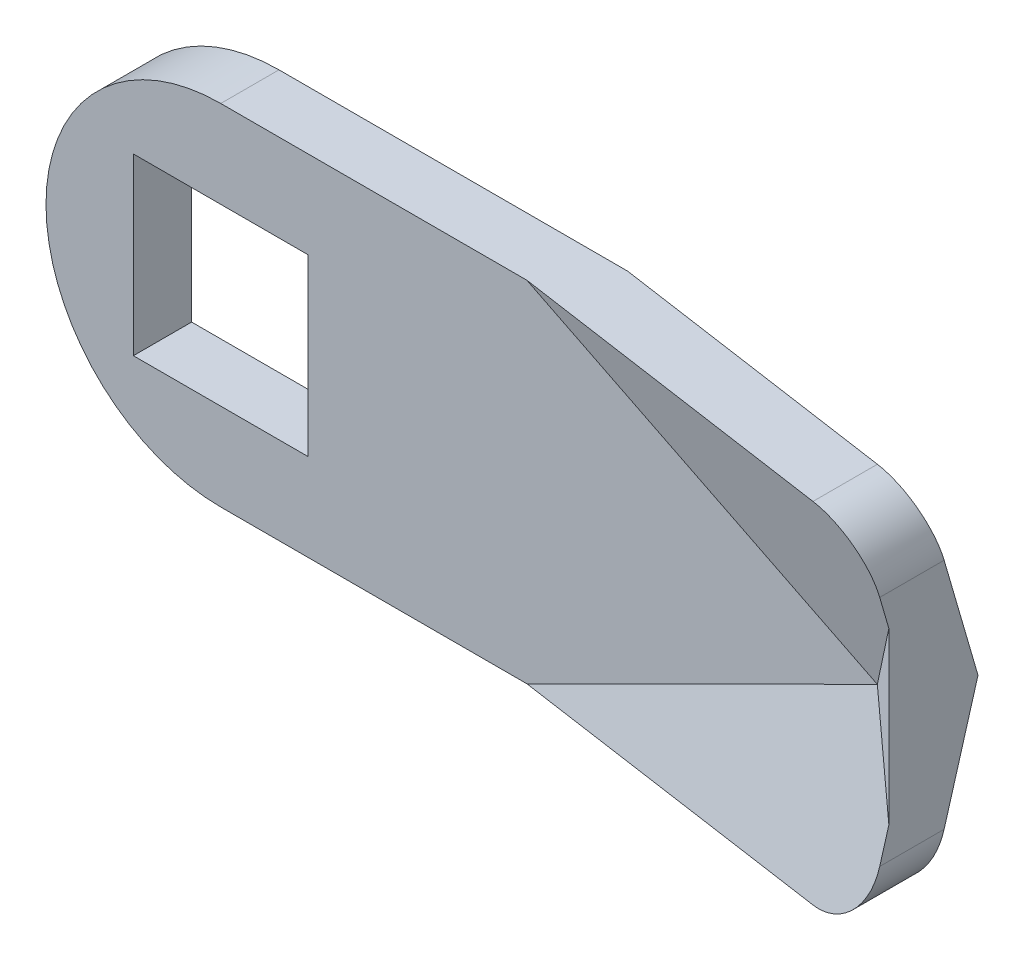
ISO-10303-21;
HEADER;
FILE_DESCRIPTION(('STEP AP214'),'2;1');
FILE_NAME('part.step','',(''),(''),'','','');
FILE_SCHEMA(('AUTOMOTIVE_DESIGN { 1 0 10303 214 1 1 1 1 }'));
ENDSEC;
DATA;
#1=APPLICATION_CONTEXT('core data for automotive mechanical design processes');
#2=APPLICATION_PROTOCOL_DEFINITION('international standard','automotive_design',2000,#1);
#3=PRODUCT_CONTEXT('',#1,'mechanical');
#4=PRODUCT('Part','Part','',(#3));
#5=PRODUCT_RELATED_PRODUCT_CATEGORY('part','',(#4));
#6=PRODUCT_DEFINITION_FORMATION('','',#4);
#7=PRODUCT_DEFINITION_CONTEXT('part definition',#1,'design');
#8=PRODUCT_DEFINITION('design','',#6,#7);
#9=PRODUCT_DEFINITION_SHAPE('','',#8);
#10=(LENGTH_UNIT() NAMED_UNIT(*) SI_UNIT(.MILLI.,.METRE.));
#11=(NAMED_UNIT(*) PLANE_ANGLE_UNIT() SI_UNIT($,.RADIAN.));
#12=(NAMED_UNIT(*) SI_UNIT($,.STERADIAN.) SOLID_ANGLE_UNIT());
#13=UNCERTAINTY_MEASURE_WITH_UNIT(LENGTH_MEASURE(1.E-05),#10,'distance_accuracy_value','');
#14=(GEOMETRIC_REPRESENTATION_CONTEXT(3) GLOBAL_UNCERTAINTY_ASSIGNED_CONTEXT((#13)) GLOBAL_UNIT_ASSIGNED_CONTEXT((#10,
#11,#12)) REPRESENTATION_CONTEXT('',''));
#15=CARTESIAN_POINT('',(0.,0.,0.));
#16=DIRECTION('',(0.,0.,1.));
#17=DIRECTION('',(1.,0.,0.));
#18=AXIS2_PLACEMENT_3D('',#15,#16,#17);
#19=CARTESIAN_POINT('',(-6.,-6.,0.));
#20=DIRECTION('',(0.,0.,1.));
#21=DIRECTION('',(-1.,0.,0.));
#22=AXIS2_PLACEMENT_3D('',#19,#20,#21);
#23=PLANE('',#22);
#24=DIRECTION('',(-1.,0.,0.));
#25=VECTOR('',#24,1.);
#26=CARTESIAN_POINT('',(3.,3.,0.));
#27=LINE('',#26,#25);
#28=CARTESIAN_POINT('',(3.,3.,0.));
#29=VERTEX_POINT('',#28);
#30=CARTESIAN_POINT('',(-3.,3.,0.));
#31=VERTEX_POINT('',#30);
#32=EDGE_CURVE('E248',#29,#31,#27,.T.);
#33=ORIENTED_EDGE('',*,*,#32,.T.);
#34=DIRECTION('',(0.,1.,0.));
#35=VECTOR('',#34,1.);
#36=CARTESIAN_POINT('',(-3.,-3.,0.));
#37=LINE('',#36,#35);
#38=CARTESIAN_POINT('',(-3.,-3.,0.));
#39=VERTEX_POINT('',#38);
#40=EDGE_CURVE('E288',#39,#31,#37,.T.);
#41=ORIENTED_EDGE('',*,*,#40,.F.);
#42=DIRECTION('',(1.,0.,0.));
#43=VECTOR('',#42,1.);
#44=CARTESIAN_POINT('',(-3.,-3.,0.));
#45=LINE('',#44,#43);
#46=CARTESIAN_POINT('',(3.,-3.,0.));
#47=VERTEX_POINT('',#46);
#48=EDGE_CURVE('E294',#39,#47,#45,.T.);
#49=ORIENTED_EDGE('',*,*,#48,.T.);
#50=DIRECTION('',(0.,-1.,0.));
#51=VECTOR('',#50,1.);
#52=CARTESIAN_POINT('',(3.,3.,0.));
#53=LINE('',#52,#51);
#54=EDGE_CURVE('E291',#29,#47,#53,.T.);
#55=ORIENTED_EDGE('',*,*,#54,.F.);
#56=EDGE_LOOP('',(#33,#41,#49,#55));
#57=FACE_BOUND('',#56,.T.);
#58=DIRECTION('',(0.,1.,0.));
#59=VECTOR('',#58,1.);
#60=CARTESIAN_POINT('',(5.,-2.85,0.));
#61=LINE('',#60,#59);
#62=CARTESIAN_POINT('',(5.,-2.85,0.));
#63=VERTEX_POINT('',#62);
#64=CARTESIAN_POINT('',(5.,2.85,0.));
#65=VERTEX_POINT('',#64);
#66=EDGE_CURVE('E250',#63,#65,#61,.T.);
#67=ORIENTED_EDGE('',*,*,#66,.F.);
#68=DIRECTION('',(1.,0.,0.));
#69=VECTOR('',#68,1.);
#70=CARTESIAN_POINT('',(5.,-2.85,0.));
#71=LINE('',#70,#69);
#72=CARTESIAN_POINT('',(10.,-2.85,0.));
#73=VERTEX_POINT('',#72);
#74=EDGE_CURVE('E253',#63,#73,#71,.T.);
#75=ORIENTED_EDGE('',*,*,#74,.T.);
#76=DIRECTION('',(0.,1.,0.));
#77=VECTOR('',#76,1.);
#78=CARTESIAN_POINT('',(10.,-2.85,0.));
#79=LINE('',#78,#77);
#80=CARTESIAN_POINT('',(10.,2.85,0.));
#81=VERTEX_POINT('',#80);
#82=EDGE_CURVE('E260',#73,#81,#79,.T.);
#83=ORIENTED_EDGE('',*,*,#82,.T.);
#84=DIRECTION('',(1.,0.,0.));
#85=VECTOR('',#84,1.);
#86=CARTESIAN_POINT('',(5.,2.85,0.));
#87=LINE('',#86,#85);
#88=EDGE_CURVE('E256',#65,#81,#87,.T.);
#89=ORIENTED_EDGE('',*,*,#88,.F.);
#90=EDGE_LOOP('',(#67,#75,#83,#89));
#91=FACE_BOUND('',#90,.T.);
#92=CARTESIAN_POINT('',(0.,0.,0.));
#93=DIRECTION('',(0.,0.,-1.));
#94=DIRECTION('',(1.,0.,0.));
#95=AXIS2_PLACEMENT_3D('',#92,#93,#94);
#96=CIRCLE('',#95,6.);
#97=CARTESIAN_POINT('',(0.,-6.,0.));
#98=VERTEX_POINT('',#97);
#99=CARTESIAN_POINT('',(0.,6.,0.));
#100=VERTEX_POINT('',#99);
#101=EDGE_CURVE('E144',#98,#100,#96,.T.);
#102=ORIENTED_EDGE('',*,*,#101,.T.);
#103=DIRECTION('',(1.,0.,0.));
#104=VECTOR('',#103,1.);
#105=CARTESIAN_POINT('',(-6.,6.,0.));
#106=LINE('',#105,#104);
#107=CARTESIAN_POINT('',(11.9658617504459,6.,0.));
#108=VERTEX_POINT('',#107);
#109=EDGE_CURVE('E148',#100,#108,#106,.T.);
#110=ORIENTED_EDGE('',*,*,#109,.T.);
#111=DIRECTION('',(-0.894934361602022,0.446197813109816,0.));
#112=VECTOR('',#111,1.);
#113=CARTESIAN_POINT('',(24.,0.,0.));
#114=LINE('',#113,#112);
#115=CARTESIAN_POINT('',(24.,0.,0.));
#116=VERTEX_POINT('',#115);
#117=EDGE_CURVE('E322',#116,#108,#114,.T.);
#118=ORIENTED_EDGE('',*,*,#117,.F.);
#119=DIRECTION('',(-0.894934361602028,-0.446197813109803,0.));
#120=VECTOR('',#119,1.);
#121=CARTESIAN_POINT('',(24.,0.,0.));
#122=LINE('',#121,#120);
#123=CARTESIAN_POINT('',(11.9658617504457,-6.,0.));
#124=VERTEX_POINT('',#123);
#125=EDGE_CURVE('E324',#116,#124,#122,.T.);
#126=ORIENTED_EDGE('',*,*,#125,.T.);
#127=DIRECTION('',(1.,0.,0.));
#128=VECTOR('',#127,1.);
#129=CARTESIAN_POINT('',(-6.,-6.,0.));
#130=LINE('',#129,#128);
#131=EDGE_CURVE('E150',#98,#124,#130,.T.);
#132=ORIENTED_EDGE('',*,*,#131,.F.);
#133=EDGE_LOOP('',(#102,#110,#118,#126,#132));
#134=FACE_BOUND('',#133,.T.);
#135=ADVANCED_FACE('F14',(#57,#91,#134),#23,.F.);
#136=CARTESIAN_POINT('',(-6.,-6.,0.));
#137=DIRECTION('',(0.,-1.,0.));
#138=DIRECTION('',(-1.,0.,0.));
#139=AXIS2_PLACEMENT_3D('',#136,#137,#138);
#140=PLANE('',#139);
#141=DIRECTION('',(1.,0.,0.));
#142=VECTOR('',#141,1.);
#143=CARTESIAN_POINT('',(-6.,-6.,2.));
#144=LINE('',#143,#142);
#145=CARTESIAN_POINT('',(0.,-6.,2.));
#146=VERTEX_POINT('',#145);
#147=CARTESIAN_POINT('',(10.5094687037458,-6.,2.));
#148=VERTEX_POINT('',#147);
#149=EDGE_CURVE('E175',#146,#148,#144,.T.);
#150=ORIENTED_EDGE('',*,*,#149,.F.);
#151=DIRECTION('',(0.,0.,-1.));
#152=VECTOR('',#151,1.);
#153=CARTESIAN_POINT('',(0.,-6.,2.));
#154=LINE('',#153,#152);
#155=EDGE_CURVE('E154',#146,#98,#154,.T.);
#156=ORIENTED_EDGE('',*,*,#155,.T.);
#157=ORIENTED_EDGE('',*,*,#131,.T.);
#158=DIRECTION('',(-0.989653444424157,0.,-0.14347843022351));
#159=VECTOR('',#158,1.);
#160=CARTESIAN_POINT('',(23.4534114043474,-6.,1.66544723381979));
#161=LINE('',#160,#159);
#162=CARTESIAN_POINT('',(22.,-6.,1.45473388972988));
#163=VERTEX_POINT('',#162);
#164=EDGE_CURVE('E178',#163,#124,#161,.T.);
#165=ORIENTED_EDGE('',*,*,#164,.F.);
#166=DIRECTION('',(0.,0.,1.));
#167=VECTOR('',#166,1.);
#168=CARTESIAN_POINT('',(22.,-6.,0.));
#169=LINE('',#168,#167);
#170=CARTESIAN_POINT('',(22.,-6.,3.66587950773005));
#171=VERTEX_POINT('',#170);
#172=EDGE_CURVE('E192',#163,#171,#169,.T.);
#173=ORIENTED_EDGE('',*,*,#172,.T.);
#174=DIRECTION('',(0.989653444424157,0.,0.14347843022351));
#175=VECTOR('',#174,1.);
#176=CARTESIAN_POINT('',(33.7834211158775,-6.,5.37422172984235));
#177=LINE('',#176,#175);
#178=EDGE_CURVE('E312',#148,#171,#177,.T.);
#179=ORIENTED_EDGE('',*,*,#178,.F.);
#180=EDGE_LOOP('',(#150,#156,#157,#165,#173,#179));
#181=FACE_BOUND('',#180,.T.);
#182=ADVANCED_FACE('F235',(#181),#140,.T.);
#183=CARTESIAN_POINT('',(-6.,6.,0.));
#184=DIRECTION('',(0.,-1.,0.));
#185=DIRECTION('',(-1.,0.,0.));
#186=AXIS2_PLACEMENT_3D('',#183,#184,#185);
#187=PLANE('',#186);
#188=DIRECTION('',(0.,0.,-1.));
#189=VECTOR('',#188,1.);
#190=CARTESIAN_POINT('',(0.,6.,2.));
#191=LINE('',#190,#189);
#192=CARTESIAN_POINT('',(0.,6.,2.));
#193=VERTEX_POINT('',#192);
#194=EDGE_CURVE('E157',#193,#100,#191,.T.);
#195=ORIENTED_EDGE('',*,*,#194,.F.);
#196=DIRECTION('',(1.,0.,0.));
#197=VECTOR('',#196,1.);
#198=CARTESIAN_POINT('',(-6.,6.,2.));
#199=LINE('',#198,#197);
#200=CARTESIAN_POINT('',(10.5094687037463,6.,2.));
#201=VERTEX_POINT('',#200);
#202=EDGE_CURVE('E165',#193,#201,#199,.T.);
#203=ORIENTED_EDGE('',*,*,#202,.T.);
#204=DIRECTION('',(0.989653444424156,0.,0.143478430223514));
#205=VECTOR('',#204,1.);
#206=CARTESIAN_POINT('',(21.9970183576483,6.,3.66544723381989));
#207=LINE('',#206,#205);
#208=CARTESIAN_POINT('',(22.,6.,3.66587950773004));
#209=VERTEX_POINT('',#208);
#210=EDGE_CURVE('E315',#201,#209,#207,.T.);
#211=ORIENTED_EDGE('',*,*,#210,.T.);
#212=DIRECTION('',(0.,0.,1.));
#213=VECTOR('',#212,1.);
#214=CARTESIAN_POINT('',(22.,6.,-18.3074169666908));
#215=LINE('',#214,#213);
#216=CARTESIAN_POINT('',(22.,6.,1.45473388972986));
#217=VERTEX_POINT('',#216);
#218=EDGE_CURVE('E28',#209,#217,#215,.F.);
#219=ORIENTED_EDGE('',*,*,#218,.T.);
#220=DIRECTION('',(-0.989653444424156,0.,-0.143478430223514));
#221=VECTOR('',#220,1.);
#222=CARTESIAN_POINT('',(35.2398141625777,6.,3.37422172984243));
#223=LINE('',#222,#221);
#224=EDGE_CURVE('E163',#217,#108,#223,.T.);
#225=ORIENTED_EDGE('',*,*,#224,.T.);
#226=ORIENTED_EDGE('',*,*,#109,.F.);
#227=EDGE_LOOP('',(#195,#203,#211,#219,#225,#226));
#228=FACE_BOUND('',#227,.T.);
#229=ADVANCED_FACE('F162',(#228),#187,.F.);
#230=CARTESIAN_POINT('',(-6.,-6.,2.));
#231=DIRECTION('',(0.,0.,1.));
#232=DIRECTION('',(-1.,0.,0.));
#233=AXIS2_PLACEMENT_3D('',#230,#231,#232);
#234=PLANE('',#233);
#235=DIRECTION('',(0.,-1.,0.));
#236=VECTOR('',#235,1.);
#237=CARTESIAN_POINT('',(-3.,-6.,2.));
#238=LINE('',#237,#236);
#239=CARTESIAN_POINT('',(-3.,3.,2.));
#240=VERTEX_POINT('',#239);
#241=CARTESIAN_POINT('',(-3.,-3.,2.));
#242=VERTEX_POINT('',#241);
#243=EDGE_CURVE('E190',#240,#242,#238,.T.);
#244=ORIENTED_EDGE('',*,*,#243,.F.);
#245=DIRECTION('',(1.,0.,0.));
#246=VECTOR('',#245,1.);
#247=CARTESIAN_POINT('',(-6.,3.,2.));
#248=LINE('',#247,#246);
#249=CARTESIAN_POINT('',(3.,3.,2.));
#250=VERTEX_POINT('',#249);
#251=EDGE_CURVE('E181',#240,#250,#248,.T.);
#252=ORIENTED_EDGE('',*,*,#251,.T.);
#253=DIRECTION('',(0.,1.,0.));
#254=VECTOR('',#253,1.);
#255=CARTESIAN_POINT('',(3.,-6.,2.));
#256=LINE('',#255,#254);
#257=CARTESIAN_POINT('',(3.,-3.,2.));
#258=VERTEX_POINT('',#257);
#259=EDGE_CURVE('E184',#258,#250,#256,.T.);
#260=ORIENTED_EDGE('',*,*,#259,.F.);
#261=DIRECTION('',(-1.,0.,0.));
#262=VECTOR('',#261,1.);
#263=CARTESIAN_POINT('',(-6.,-3.,2.));
#264=LINE('',#263,#262);
#265=EDGE_CURVE('E187',#258,#242,#264,.T.);
#266=ORIENTED_EDGE('',*,*,#265,.T.);
#267=EDGE_LOOP('',(#244,#252,#260,#266));
#268=FACE_BOUND('',#267,.T.);
#269=CARTESIAN_POINT('',(0.,0.,2.));
#270=DIRECTION('',(0.,0.,1.));
#271=DIRECTION('',(-1.,0.,0.));
#272=AXIS2_PLACEMENT_3D('',#269,#270,#271);
#273=CIRCLE('',#272,6.);
#274=EDGE_CURVE('E9',#193,#146,#273,.T.);
#275=ORIENTED_EDGE('',*,*,#274,.T.);
#276=ORIENTED_EDGE('',*,*,#149,.T.);
#277=DIRECTION('',(0.894934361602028,0.446197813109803,0.));
#278=VECTOR('',#277,1.);
#279=CARTESIAN_POINT('',(23.7100430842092,0.581563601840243,2.));
#280=LINE('',#279,#278);
#281=CARTESIAN_POINT('',(22.5436069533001,0.,2.));
#282=VERTEX_POINT('',#281);
#283=EDGE_CURVE('E166',#282,#148,#280,.F.);
#284=ORIENTED_EDGE('',*,*,#283,.F.);
#285=DIRECTION('',(-0.894934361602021,0.446197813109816,0.));
#286=VECTOR('',#285,1.);
#287=CARTESIAN_POINT('',(23.7100430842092,-0.581563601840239,2.));
#288=LINE('',#287,#286);
#289=EDGE_CURVE('E170',#282,#201,#288,.T.);
#290=ORIENTED_EDGE('',*,*,#289,.T.);
#291=ORIENTED_EDGE('',*,*,#202,.F.);
#292=EDGE_LOOP('',(#275,#276,#284,#290,#291));
#293=FACE_BOUND('',#292,.T.);
#294=ADVANCED_FACE('F329',(#268,#293),#234,.T.);
#295=CARTESIAN_POINT('',(21.1184521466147,27.2783289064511,9.72542485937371));
#296=DIRECTION('',(0.13788270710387,0.27654992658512,-0.951056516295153));
#297=DIRECTION('',(0.,-0.960228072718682,-0.279216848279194));
#298=AXIS2_PLACEMENT_3D('',#295,#296,#297);
#299=PLANE('',#298);
#300=DIRECTION('',(0.,-0.960228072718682,-0.279216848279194));
#301=VECTOR('',#300,1.);
#302=CARTESIAN_POINT('',(24.,27.1663218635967,10.1106176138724));
#303=LINE('',#302,#301);
#304=CARTESIAN_POINT('',(24.,4.,3.37427282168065));
#305=VERTEX_POINT('',#304);
#306=CARTESIAN_POINT('',(24.,2.92107254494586,3.06054035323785));
#307=VERTEX_POINT('',#306);
#308=EDGE_CURVE('E218',#305,#307,#303,.T.);
#309=ORIENTED_EDGE('',*,*,#308,.F.);
#310=CARTESIAN_POINT('',(22.,4.,3.08431590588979));
#311=DIRECTION('',(0.13788270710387,0.27654992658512,-0.951056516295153));
#312=DIRECTION('',(-0.424359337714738,-0.851133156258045,-0.309016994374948));
#313=AXIS2_PLACEMENT_3D('',#310,#311,#312);
#314=ELLIPSE('',#313,2.10292444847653,2.);
#315=EDGE_CURVE('E36',#305,#209,#314,.F.);
#316=ORIENTED_EDGE('',*,*,#315,.T.);
#317=ORIENTED_EDGE('',*,*,#210,.F.);
#318=ORIENTED_EDGE('',*,*,#289,.F.);
#319=DIRECTION('',(-0.424359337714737,-0.851133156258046,-0.309016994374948));
#320=VECTOR('',#319,1.);
#321=CARTESIAN_POINT('',(33.1525903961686,21.2783289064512,9.72542485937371));
#322=LINE('',#321,#320);
#323=EDGE_CURVE('E317',#307,#282,#322,.T.);
#324=ORIENTED_EDGE('',*,*,#323,.F.);
#325=EDGE_LOOP('',(#309,#316,#317,#318,#324));
#326=FACE_BOUND('',#325,.T.);
#327=ADVANCED_FACE('F331',(#326),#299,.F.);
#328=CARTESIAN_POINT('',(34.6089834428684,21.2783289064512,7.72542485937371));
#329=DIRECTION('',(-0.13788270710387,-0.27654992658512,0.951056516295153));
#330=DIRECTION('',(0.,0.960228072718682,0.279216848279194));
#331=AXIS2_PLACEMENT_3D('',#328,#329,#330);
#332=PLANE('',#331);
#333=ORIENTED_EDGE('',*,*,#224,.F.);
#334=CARTESIAN_POINT('',(22.,4.,0.873170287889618));
#335=DIRECTION('',(-0.13788270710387,-0.27654992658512,0.951056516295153));
#336=DIRECTION('',(-0.424359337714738,-0.851133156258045,-0.309016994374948));
#337=AXIS2_PLACEMENT_3D('',#334,#335,#336);
#338=ELLIPSE('',#337,2.10292444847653,2.);
#339=CARTESIAN_POINT('',(24.,4.,1.16312720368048));
#340=VERTEX_POINT('',#339);
#341=EDGE_CURVE('E21',#217,#340,#338,.F.);
#342=ORIENTED_EDGE('',*,*,#341,.T.);
#343=DIRECTION('',(0.,0.960228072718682,0.279216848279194));
#344=VECTOR('',#343,1.);
#345=CARTESIAN_POINT('',(24.,21.6907047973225,6.30726220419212));
#346=LINE('',#345,#344);
#347=EDGE_CURVE('E210',#116,#340,#346,.T.);
#348=ORIENTED_EDGE('',*,*,#347,.F.);
#349=ORIENTED_EDGE('',*,*,#117,.T.);
#350=EDGE_LOOP('',(#333,#342,#348,#349));
#351=FACE_BOUND('',#350,.T.);
#352=ADVANCED_FACE('F209',(#351),#332,.F.);
#353=CARTESIAN_POINT('',(33.1525903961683,-21.2783289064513,9.7254248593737));
#354=DIRECTION('',(0.137882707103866,-0.276549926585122,-0.951056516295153));
#355=DIRECTION('',(0.,-0.960228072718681,0.279216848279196));
#356=AXIS2_PLACEMENT_3D('',#353,#354,#355);
#357=PLANE('',#356);
#358=ORIENTED_EDGE('',*,*,#178,.T.);
#359=CARTESIAN_POINT('',(22.,-4.,3.08431590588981));
#360=DIRECTION('',(0.137882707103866,-0.276549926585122,-0.951056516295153));
#361=DIRECTION('',(0.424359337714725,-0.851133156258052,0.309016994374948));
#362=AXIS2_PLACEMENT_3D('',#359,#360,#361);
#363=ELLIPSE('',#362,2.10292444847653,2.);
#364=CARTESIAN_POINT('',(24.,-4.,3.37427282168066));
#365=VERTEX_POINT('',#364);
#366=EDGE_CURVE('E195',#171,#365,#363,.F.);
#367=ORIENTED_EDGE('',*,*,#366,.T.);
#368=DIRECTION('',(0.,-0.960228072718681,0.279216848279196));
#369=VECTOR('',#368,1.);
#370=CARTESIAN_POINT('',(24.,-21.6340941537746,8.5019464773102));
#371=LINE('',#370,#369);
#372=CARTESIAN_POINT('',(24.,-2.92107254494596,3.06054035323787));
#373=VERTEX_POINT('',#372);
#374=EDGE_CURVE('E308',#373,#365,#371,.T.);
#375=ORIENTED_EDGE('',*,*,#374,.F.);
#376=DIRECTION('',(-0.424359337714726,0.851133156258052,-0.309016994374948));
#377=VECTOR('',#376,1.);
#378=CARTESIAN_POINT('',(33.1525903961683,-21.2783289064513,9.7254248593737));
#379=LINE('',#378,#377);
#380=EDGE_CURVE('E320',#373,#282,#379,.T.);
#381=ORIENTED_EDGE('',*,*,#380,.T.);
#382=ORIENTED_EDGE('',*,*,#283,.T.);
#383=EDGE_LOOP('',(#358,#367,#375,#381,#382));
#384=FACE_BOUND('',#383,.T.);
#385=ADVANCED_FACE('F339',(#384),#357,.F.);
#386=CARTESIAN_POINT('',(22.5748451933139,-27.2783289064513,7.72542485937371));
#387=DIRECTION('',(-0.137882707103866,0.276549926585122,0.951056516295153));
#388=DIRECTION('',(0.,0.960228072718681,-0.279216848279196));
#389=AXIS2_PLACEMENT_3D('',#386,#387,#388);
#390=PLANE('',#389);
#391=DIRECTION('',(0.,0.960228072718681,-0.279216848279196));
#392=VECTOR('',#391,1.);
#393=CARTESIAN_POINT('',(24.,-27.2229325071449,7.91593334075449));
#394=LINE('',#393,#392);
#395=CARTESIAN_POINT('',(24.,-4.,1.16312720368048));
#396=VERTEX_POINT('',#395);
#397=EDGE_CURVE('E217',#396,#116,#394,.T.);
#398=ORIENTED_EDGE('',*,*,#397,.F.);
#399=CARTESIAN_POINT('',(22.,-4.,0.873170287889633));
#400=DIRECTION('',(-0.137882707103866,0.276549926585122,0.951056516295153));
#401=DIRECTION('',(0.424359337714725,-0.851133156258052,0.309016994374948));
#402=AXIS2_PLACEMENT_3D('',#399,#400,#401);
#403=ELLIPSE('',#402,2.10292444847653,2.);
#404=EDGE_CURVE('E202',#396,#163,#403,.F.);
#405=ORIENTED_EDGE('',*,*,#404,.T.);
#406=ORIENTED_EDGE('',*,*,#164,.T.);
#407=ORIENTED_EDGE('',*,*,#125,.F.);
#408=EDGE_LOOP('',(#398,#405,#406,#407));
#409=FACE_BOUND('',#408,.T.);
#410=ADVANCED_FACE('F347',(#409),#390,.F.);
#411=CARTESIAN_POINT('',(29.4240032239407,5.24949855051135,7.01028064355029));
#412=DIRECTION('',(0.588660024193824,0.,-0.808380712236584));
#413=DIRECTION('',(0.808380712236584,0.,0.588660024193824));
#414=AXIS2_PLACEMENT_3D('',#411,#412,#413);
#415=PLANE('',#414);
#416=DIRECTION('',(0.,-1.,0.));
#417=VECTOR('',#416,1.);
#418=CARTESIAN_POINT('',(24.,5.24949855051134,3.06054035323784));
#419=LINE('',#418,#417);
#420=EDGE_CURVE('E306',#307,#373,#419,.T.);
#421=ORIENTED_EDGE('',*,*,#420,.F.);
#422=ORIENTED_EDGE('',*,*,#323,.T.);
#423=ORIENTED_EDGE('',*,*,#380,.F.);
#424=EDGE_LOOP('',(#421,#422,#423));
#425=FACE_BOUND('',#424,.T.);
#426=ADVANCED_FACE('F335',(#425),#415,.F.);
#427=CARTESIAN_POINT('',(24.,44.,-18.3074169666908));
#428=DIRECTION('',(1.,0.,0.));
#429=DIRECTION('',(0.,-1.,0.));
#430=AXIS2_PLACEMENT_3D('',#427,#428,#429);
#431=PLANE('',#430);
#432=ORIENTED_EDGE('',*,*,#374,.T.);
#433=DIRECTION('',(0.,0.,1.));
#434=VECTOR('',#433,1.);
#435=CARTESIAN_POINT('',(24.,-4.,-18.3074169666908));
#436=LINE('',#435,#434);
#437=EDGE_CURVE('E200',#365,#396,#436,.F.);
#438=ORIENTED_EDGE('',*,*,#437,.T.);
#439=ORIENTED_EDGE('',*,*,#397,.T.);
#440=ORIENTED_EDGE('',*,*,#347,.T.);
#441=DIRECTION('',(0.,0.,1.));
#442=VECTOR('',#441,1.);
#443=CARTESIAN_POINT('',(24.,4.,-18.3074169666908));
#444=LINE('',#443,#442);
#445=EDGE_CURVE('E197',#340,#305,#444,.T.);
#446=ORIENTED_EDGE('',*,*,#445,.T.);
#447=ORIENTED_EDGE('',*,*,#308,.T.);
#448=ORIENTED_EDGE('',*,*,#420,.T.);
#449=EDGE_LOOP('',(#432,#438,#439,#440,#446,#447,#448));
#450=FACE_BOUND('',#449,.T.);
#451=ADVANCED_FACE('F215',(#450),#431,.T.);
#452=CARTESIAN_POINT('',(-3.,-3.,50.));
#453=DIRECTION('',(-1.,0.,0.));
#454=DIRECTION('',(0.,1.,0.));
#455=AXIS2_PLACEMENT_3D('',#452,#453,#454);
#456=PLANE('',#455);
#457=ORIENTED_EDGE('',*,*,#243,.T.);
#458=DIRECTION('',(0.,0.,-1.));
#459=VECTOR('',#458,1.);
#460=CARTESIAN_POINT('',(-3.,-3.,50.));
#461=LINE('',#460,#459);
#462=EDGE_CURVE('E304',#242,#39,#461,.T.);
#463=ORIENTED_EDGE('',*,*,#462,.T.);
#464=ORIENTED_EDGE('',*,*,#40,.T.);
#465=DIRECTION('',(0.,0.,-1.));
#466=VECTOR('',#465,1.);
#467=CARTESIAN_POINT('',(-3.,3.,50.));
#468=LINE('',#467,#466);
#469=EDGE_CURVE('E297',#240,#31,#468,.T.);
#470=ORIENTED_EDGE('',*,*,#469,.F.);
#471=EDGE_LOOP('',(#457,#463,#464,#470));
#472=FACE_BOUND('',#471,.T.);
#473=ADVANCED_FACE('F372',(#472),#456,.F.);
#474=CARTESIAN_POINT('',(-3.,-3.,50.));
#475=DIRECTION('',(0.,1.,0.));
#476=DIRECTION('',(1.,0.,0.));
#477=AXIS2_PLACEMENT_3D('',#474,#475,#476);
#478=PLANE('',#477);
#479=DIRECTION('',(0.,0.,-1.));
#480=VECTOR('',#479,1.);
#481=CARTESIAN_POINT('',(3.,-3.,50.));
#482=LINE('',#481,#480);
#483=EDGE_CURVE('E302',#258,#47,#482,.T.);
#484=ORIENTED_EDGE('',*,*,#483,.T.);
#485=ORIENTED_EDGE('',*,*,#48,.F.);
#486=ORIENTED_EDGE('',*,*,#462,.F.);
#487=ORIENTED_EDGE('',*,*,#265,.F.);
#488=EDGE_LOOP('',(#484,#485,#486,#487));
#489=FACE_BOUND('',#488,.T.);
#490=ADVANCED_FACE('F375',(#489),#478,.T.);
#491=CARTESIAN_POINT('',(3.,3.,50.));
#492=DIRECTION('',(1.,0.,0.));
#493=DIRECTION('',(0.,0.,1.));
#494=AXIS2_PLACEMENT_3D('',#491,#492,#493);
#495=PLANE('',#494);
#496=ORIENTED_EDGE('',*,*,#259,.T.);
#497=DIRECTION('',(0.,0.,-1.));
#498=VECTOR('',#497,1.);
#499=CARTESIAN_POINT('',(3.,3.,50.));
#500=LINE('',#499,#498);
#501=EDGE_CURVE('E300',#250,#29,#500,.T.);
#502=ORIENTED_EDGE('',*,*,#501,.T.);
#503=ORIENTED_EDGE('',*,*,#54,.T.);
#504=ORIENTED_EDGE('',*,*,#483,.F.);
#505=EDGE_LOOP('',(#496,#502,#503,#504));
#506=FACE_BOUND('',#505,.T.);
#507=ADVANCED_FACE('F380',(#506),#495,.F.);
#508=CARTESIAN_POINT('',(3.,3.,50.));
#509=DIRECTION('',(0.,-1.,0.));
#510=DIRECTION('',(-1.,0.,0.));
#511=AXIS2_PLACEMENT_3D('',#508,#509,#510);
#512=PLANE('',#511);
#513=ORIENTED_EDGE('',*,*,#469,.T.);
#514=ORIENTED_EDGE('',*,*,#32,.F.);
#515=ORIENTED_EDGE('',*,*,#501,.F.);
#516=ORIENTED_EDGE('',*,*,#251,.F.);
#517=EDGE_LOOP('',(#513,#514,#515,#516));
#518=FACE_BOUND('',#517,.T.);
#519=ADVANCED_FACE('F378',(#518),#512,.T.);
#520=CARTESIAN_POINT('',(6.8,-2.85,-1.8));
#521=DIRECTION('',(0.,0.,-1.));
#522=DIRECTION('',(1.,0.,0.));
#523=AXIS2_PLACEMENT_3D('',#520,#521,#522);
#524=PLANE('',#523);
#525=DIRECTION('',(0.,1.,0.));
#526=VECTOR('',#525,1.);
#527=CARTESIAN_POINT('',(6.8,-2.85,-1.8));
#528=LINE('',#527,#526);
#529=CARTESIAN_POINT('',(6.8,-2.85,-1.8));
#530=VERTEX_POINT('',#529);
#531=CARTESIAN_POINT('',(6.8,2.85,-1.8));
#532=VERTEX_POINT('',#531);
#533=EDGE_CURVE('E286',#530,#532,#528,.T.);
#534=ORIENTED_EDGE('',*,*,#533,.F.);
#535=DIRECTION('',(-1.,0.,0.));
#536=VECTOR('',#535,1.);
#537=CARTESIAN_POINT('',(6.8,-2.85,-1.8));
#538=LINE('',#537,#536);
#539=CARTESIAN_POINT('',(5.,-2.85,-1.8));
#540=VERTEX_POINT('',#539);
#541=EDGE_CURVE('E269',#530,#540,#538,.T.);
#542=ORIENTED_EDGE('',*,*,#541,.T.);
#543=DIRECTION('',(0.,1.,0.));
#544=VECTOR('',#543,1.);
#545=CARTESIAN_POINT('',(5.,-2.85,-1.8));
#546=LINE('',#545,#544);
#547=CARTESIAN_POINT('',(5.,2.85,-1.8));
#548=VERTEX_POINT('',#547);
#549=EDGE_CURVE('E261',#540,#548,#546,.T.);
#550=ORIENTED_EDGE('',*,*,#549,.T.);
#551=DIRECTION('',(-1.,0.,0.));
#552=VECTOR('',#551,1.);
#553=CARTESIAN_POINT('',(6.8,2.85,-1.8));
#554=LINE('',#553,#552);
#555=EDGE_CURVE('E160',#532,#548,#554,.T.);
#556=ORIENTED_EDGE('',*,*,#555,.F.);
#557=EDGE_LOOP('',(#534,#542,#550,#556));
#558=FACE_BOUND('',#557,.T.);
#559=ADVANCED_FACE('F388',(#558),#524,.T.);
#560=CARTESIAN_POINT('',(6.8,-2.85,-1.8));
#561=DIRECTION('',(-0.29237170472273,0.,0.956304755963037));
#562=DIRECTION('',(-0.956304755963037,0.,-0.29237170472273));
#563=AXIS2_PLACEMENT_3D('',#560,#561,#562);
#564=PLANE('',#563);
#565=DIRECTION('',(0.,1.,0.));
#566=VECTOR('',#565,1.);
#567=CARTESIAN_POINT('',(10.,-2.85,-0.82166181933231));
#568=LINE('',#567,#566);
#569=CARTESIAN_POINT('',(10.,-2.85,-0.82166181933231));
#570=VERTEX_POINT('',#569);
#571=CARTESIAN_POINT('',(10.,2.85,-0.82166181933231));
#572=VERTEX_POINT('',#571);
#573=EDGE_CURVE('E284',#570,#572,#568,.T.);
#574=ORIENTED_EDGE('',*,*,#573,.F.);
#575=DIRECTION('',(0.956304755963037,0.,0.29237170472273));
#576=VECTOR('',#575,1.);
#577=CARTESIAN_POINT('',(6.8,-2.85,-1.8));
#578=LINE('',#577,#576);
#579=EDGE_CURVE('E277',#530,#570,#578,.T.);
#580=ORIENTED_EDGE('',*,*,#579,.F.);
#581=ORIENTED_EDGE('',*,*,#533,.T.);
#582=DIRECTION('',(0.956304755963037,0.,0.29237170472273));
#583=VECTOR('',#582,1.);
#584=CARTESIAN_POINT('',(6.8,2.85,-1.8));
#585=LINE('',#584,#583);
#586=EDGE_CURVE('E549',#532,#572,#585,.T.);
#587=ORIENTED_EDGE('',*,*,#586,.T.);
#588=EDGE_LOOP('',(#574,#580,#581,#587));
#589=FACE_BOUND('',#588,.T.);
#590=ADVANCED_FACE('F467',(#589),#564,.F.);
#591=CARTESIAN_POINT('',(10.,-2.85,-0.82166181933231));
#592=DIRECTION('',(-1.,0.,0.));
#593=DIRECTION('',(0.,1.,0.));
#594=AXIS2_PLACEMENT_3D('',#591,#592,#593);
#595=PLANE('',#594);
#596=ORIENTED_EDGE('',*,*,#82,.F.);
#597=DIRECTION('',(0.,0.,1.));
#598=VECTOR('',#597,1.);
#599=CARTESIAN_POINT('',(10.,-2.85,-0.82166181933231));
#600=LINE('',#599,#598);
#601=EDGE_CURVE('E275',#570,#73,#600,.T.);
#602=ORIENTED_EDGE('',*,*,#601,.F.);
#603=ORIENTED_EDGE('',*,*,#573,.T.);
#604=DIRECTION('',(0.,0.,1.));
#605=VECTOR('',#604,1.);
#606=CARTESIAN_POINT('',(10.,2.85,-0.82166181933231));
#607=LINE('',#606,#605);
#608=EDGE_CURVE('E552',#572,#81,#607,.T.);
#609=ORIENTED_EDGE('',*,*,#608,.T.);
#610=EDGE_LOOP('',(#596,#602,#603,#609));
#611=FACE_BOUND('',#610,.T.);
#612=ADVANCED_FACE('F477',(#611),#595,.F.);
#613=CARTESIAN_POINT('',(5.,-2.85,-1.8));
#614=DIRECTION('',(-1.,0.,0.));
#615=DIRECTION('',(0.,0.,-1.));
#616=AXIS2_PLACEMENT_3D('',#613,#614,#615);
#617=PLANE('',#616);
#618=DIRECTION('',(0.,0.,1.));
#619=VECTOR('',#618,1.);
#620=CARTESIAN_POINT('',(5.,-2.85,-1.8));
#621=LINE('',#620,#619);
#622=EDGE_CURVE('E264',#540,#63,#621,.T.);
#623=ORIENTED_EDGE('',*,*,#622,.T.);
#624=ORIENTED_EDGE('',*,*,#66,.T.);
#625=DIRECTION('',(0.,0.,1.));
#626=VECTOR('',#625,1.);
#627=CARTESIAN_POINT('',(5.,2.85,-1.8));
#628=LINE('',#627,#626);
#629=EDGE_CURVE('E546',#548,#65,#628,.T.);
#630=ORIENTED_EDGE('',*,*,#629,.F.);
#631=ORIENTED_EDGE('',*,*,#549,.F.);
#632=EDGE_LOOP('',(#623,#624,#630,#631));
#633=FACE_BOUND('',#632,.T.);
#634=ADVANCED_FACE('F265',(#633),#617,.T.);
#635=CARTESIAN_POINT('',(10.,-2.85,-1.8));
#636=DIRECTION('',(0.,1.,0.));
#637=DIRECTION('',(1.,0.,0.));
#638=AXIS2_PLACEMENT_3D('',#635,#636,#637);
#639=PLANE('',#638);
#640=ORIENTED_EDGE('',*,*,#541,.F.);
#641=ORIENTED_EDGE('',*,*,#579,.T.);
#642=ORIENTED_EDGE('',*,*,#601,.T.);
#643=ORIENTED_EDGE('',*,*,#74,.F.);
#644=ORIENTED_EDGE('',*,*,#622,.F.);
#645=EDGE_LOOP('',(#640,#641,#642,#643,#644));
#646=FACE_BOUND('',#645,.T.);
#647=ADVANCED_FACE('F272',(#646),#639,.F.);
#648=CARTESIAN_POINT('',(10.,2.85,-1.8));
#649=DIRECTION('',(0.,1.,0.));
#650=DIRECTION('',(1.,0.,0.));
#651=AXIS2_PLACEMENT_3D('',#648,#649,#650);
#652=PLANE('',#651);
#653=ORIENTED_EDGE('',*,*,#555,.T.);
#654=ORIENTED_EDGE('',*,*,#629,.T.);
#655=ORIENTED_EDGE('',*,*,#88,.T.);
#656=ORIENTED_EDGE('',*,*,#608,.F.);
#657=ORIENTED_EDGE('',*,*,#586,.F.);
#658=EDGE_LOOP('',(#653,#654,#655,#656,#657));
#659=FACE_BOUND('',#658,.T.);
#660=ADVANCED_FACE('F231',(#659),#652,.T.);
#661=CARTESIAN_POINT('',(22.,-4.,0.));
#662=DIRECTION('',(0.,0.,1.));
#663=DIRECTION('',(0.,1.,0.));
#664=AXIS2_PLACEMENT_3D('',#661,#662,#663);
#665=CYLINDRICAL_SURFACE('',#664,2.);
#666=ORIENTED_EDGE('',*,*,#404,.F.);
#667=ORIENTED_EDGE('',*,*,#437,.F.);
#668=ORIENTED_EDGE('',*,*,#366,.F.);
#669=ORIENTED_EDGE('',*,*,#172,.F.);
#670=EDGE_LOOP('',(#666,#667,#668,#669));
#671=FACE_BOUND('',#670,.T.);
#672=ADVANCED_FACE('F222',(#671),#665,.T.);
#673=CARTESIAN_POINT('',(22.,4.,-18.3074169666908));
#674=DIRECTION('',(0.,0.,-1.));
#675=DIRECTION('',(0.,-1.,0.));
#676=AXIS2_PLACEMENT_3D('',#673,#674,#675);
#677=CYLINDRICAL_SURFACE('',#676,2.);
#678=ORIENTED_EDGE('',*,*,#341,.F.);
#679=ORIENTED_EDGE('',*,*,#218,.F.);
#680=ORIENTED_EDGE('',*,*,#315,.F.);
#681=ORIENTED_EDGE('',*,*,#445,.F.);
#682=EDGE_LOOP('',(#678,#679,#680,#681));
#683=FACE_BOUND('',#682,.T.);
#684=ADVANCED_FACE('F220',(#683),#677,.T.);
#685=CARTESIAN_POINT('',(0.,0.,2.));
#686=DIRECTION('',(0.,0.,-1.));
#687=DIRECTION('',(1.,0.,0.));
#688=AXIS2_PLACEMENT_3D('',#685,#686,#687);
#689=CYLINDRICAL_SURFACE('',#688,6.);
#690=ORIENTED_EDGE('',*,*,#155,.F.);
#691=ORIENTED_EDGE('',*,*,#274,.F.);
#692=ORIENTED_EDGE('',*,*,#194,.T.);
#693=ORIENTED_EDGE('',*,*,#101,.F.);
#694=EDGE_LOOP('',(#690,#691,#692,#693));
#695=FACE_BOUND('',#694,.T.);
#696=ADVANCED_FACE('F158',(#695),#689,.T.);
#697=CLOSED_SHELL('',(#135,#182,#229,#294,#327,#352,#385,#410,#426,#451,#473,#490,#507,#519,
#559,#590,#612,#634,#647,#660,#672,#684,#696));
#698=MANIFOLD_SOLID_BREP('B1',#697);
#699=ADVANCED_BREP_SHAPE_REPRESENTATION('',(#18,#698),#14);
#700=SHAPE_DEFINITION_REPRESENTATION(#9,#699);
ENDSEC;
END-ISO-10303-21;
